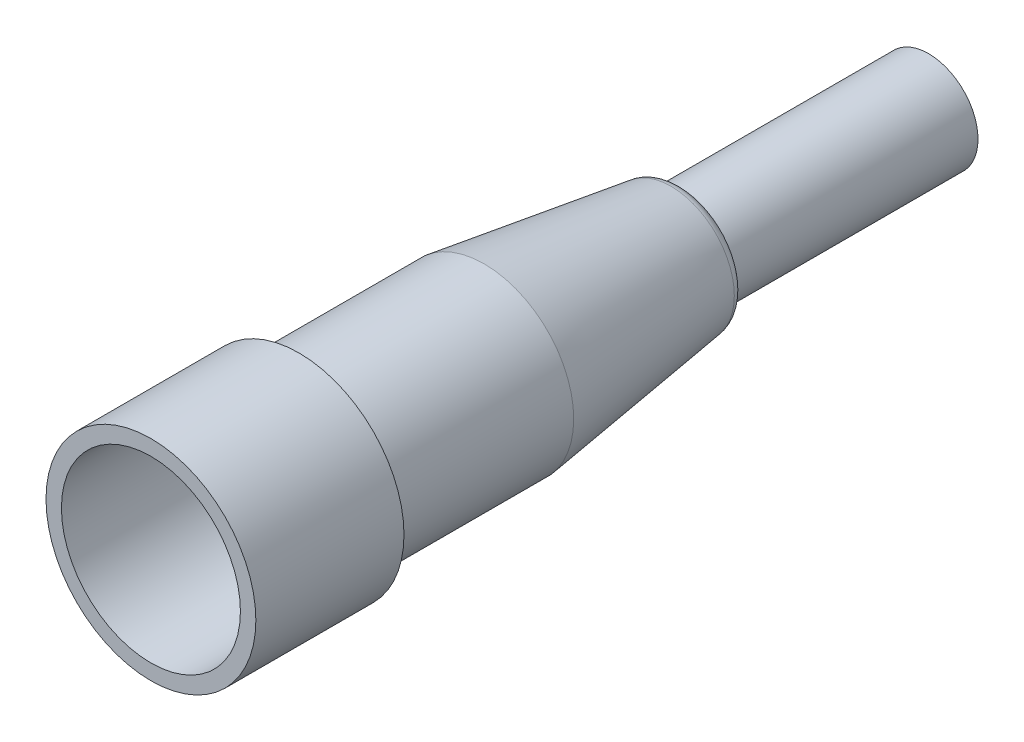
from build123d import *

# Parameters (mm, degrees)
ESQUISSE1_R             = 7.25
BASE_EXTRUSION_DEPTH    = 15
EXTRUSION1_START        = 1
ESQUISSE9_R             = 7.25
EXTRUSION1_DEPTH        = 1
ESQUISSE10_R            = 8.5
EXTRUSION2_DEPTH        = 12
ESQUISSE11_R            = 7.25
ENL_V_MAT_EXTRU_4_DEPTH = 12
CONG_1_R                = 1
ESQUISSE13_R            = 4
EXTRUSION3_DEPTH        = 20


with BuildPart() as part:
    # Esquisse1 → Base-Extrusion (new, symmetric)
    with BuildSketch(Plane.XY):
        Circle(ESQUISSE1_R)
    extrude(amount=BASE_EXTRUSION_DEPTH, both=True)

    # Esquisse9 → Extrusion1 (add)
    with BuildSketch(Plane.XY.offset(15).offset(EXTRUSION1_START)):
        Circle(ESQUISSE9_R)
    extrude(amount=-EXTRUSION1_DEPTH)

    # Esquisse12 → Enl_vement de mati_re-R_volution1 (revolve, cut)
    with BuildSketch(Plane(origin=(0, 0, 0), x_dir=(1, 0, 0), z_dir=(0, 1, 0))):
        Polygon((7.25, -1), (5, 15), (7.25, 15), align=None)
    revolve(axis=Axis((0, 0, 0), (0, 0, -1)), mode=Mode.SUBTRACT)

    # Cong_1
    cong_1_edges = [part.edges().sort_by_distance(p)[0] for p in [
        (-5, 0, -15),
    ]]
    fillet(cong_1_edges, radius=CONG_1_R)

    # Esquisse13 → Extrusion3 (add)
    with BuildSketch(Plane(origin=(0, 0, -15), x_dir=(-1, 0, 0), z_dir=(0, 0, -1))):
        with Locations(Location((0, 0, 0), (0, 0, 180))):
            Circle(ESQUISSE13_R)
    extrude(amount=EXTRUSION3_DEPTH)


with BuildPart() as body_2:
    # Esquisse10 → Extrusion2 (new body)
    with BuildSketch(Plane.XY.offset(16)):
        Circle(ESQUISSE10_R)
    extrude(amount=EXTRUSION2_DEPTH)

    # Esquisse11 → Enl_v. mat.-Extru.4 (cut)
    with BuildSketch(Plane.XY.offset(28)):
        Circle(ESQUISSE11_R)
    extrude(amount=-ENL_V_MAT_EXTRU_4_DEPTH, mode=Mode.SUBTRACT)


solid = Compound([part.part, body_2.part])
